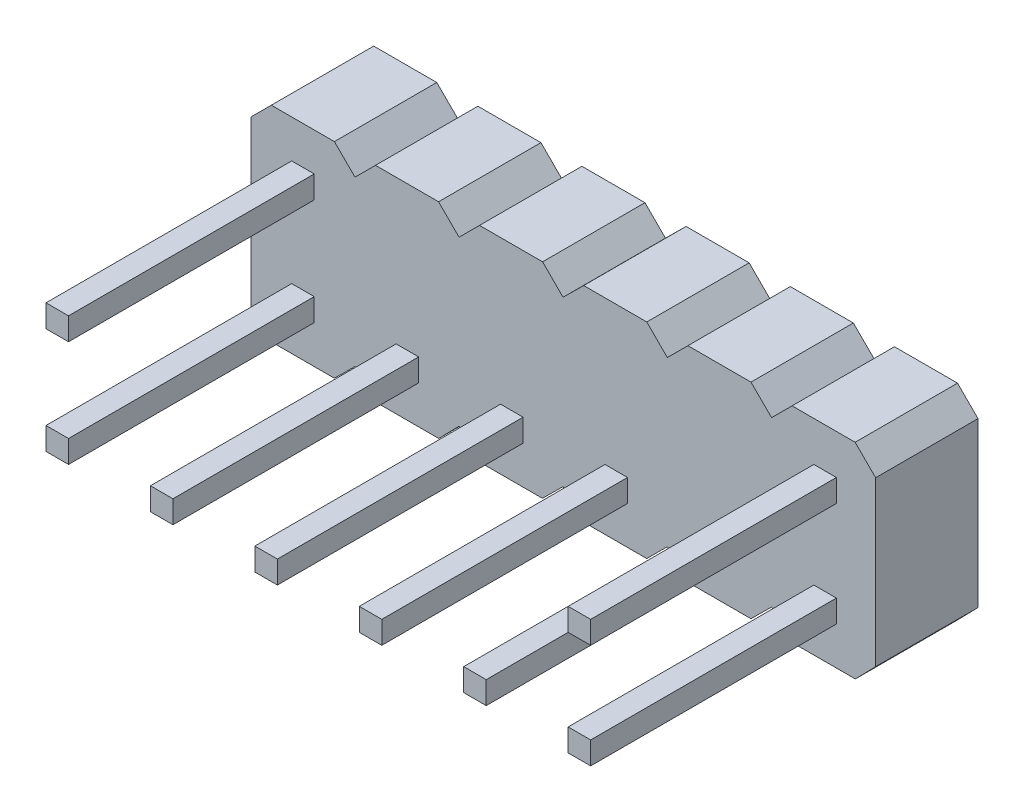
from build123d import *

# Parameters (mm, degrees)
BOSS_EXTRUDE1_DEPTH = 2.5
SKETCH2_W           = 0.55
SKETCH2_H           = 0.55
BOSS_EXTRUDE2_DEPTH = 6


with BuildPart() as part:
    # Sketch1 → Boss-Extrude1 (new body)
    with BuildSketch(Plane.XY):
        Polygon((0, 0), (0, 4), (0.502045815, 4.502045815), (2.042045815, 4.502045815), (2.546129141, 4.002045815), (3.046129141, 4.502045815), (4.586129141, 4.502045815), (5.086129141, 4.002045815), (5.586129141, 4.502045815), (7.126129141, 4.502045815), (7.626129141, 4.002045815), (8.130212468, 4.502045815), (9.670212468, 4.502045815), (10.172258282, 4), (10.674304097, 4.502045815), (12.214304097, 4.502045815), (12.718387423, 4.002045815), (13.218387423, 4.502045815), (14.758387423, 4.502045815), (15.258387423, 4.002045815), (15.258387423, 0.006055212), (14.76247075, -0.502045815), (13.22247075, -0.502045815), (12.718387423, -0.002045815), (12.214304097, -0.502045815), (10.674304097, -0.502045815), (10.172258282, 0), (9.670212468, -0.502045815), (8.130212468, -0.502045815), (7.626129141, -0.002045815), (7.122045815, -0.502045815), (5.582045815, -0.502045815), (5.086129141, 0.006055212), (4.590212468, -0.502045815), (3.050212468, -0.502045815), (2.546129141, -0.002045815), (2.042045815, -0.502045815), (0.502045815, -0.502045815), align=None)
    extrude(amount=BOSS_EXTRUDE1_DEPTH)

    # Sketch2 → Boss-Extrude2 (add)
    with BuildSketch(Plane.XY.offset(2.5)):
        with Locations((1.275, 0.702954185)):
            Rectangle(SKETCH2_W, SKETCH2_H)
        with Locations((1.275, 3.297045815)):
            Rectangle(SKETCH2_W, SKETCH2_H)
        with Locations((3.825, 0.702954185)):
            Rectangle(SKETCH2_W, SKETCH2_H)
        with Locations((6.375, 0.702954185)):
            Rectangle(SKETCH2_W, SKETCH2_H)
        with Locations((8.925, 0.702954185)):
            Rectangle(SKETCH2_W, SKETCH2_H)
        with Locations((11.475, 0.702954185)):
            Rectangle(SKETCH2_W, SKETCH2_H)
        with Locations((14.025, 0.702954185)):
            Rectangle(SKETCH2_W, SKETCH2_H)
        with Locations((14.025, 3.252954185)):
            Rectangle(SKETCH2_W, SKETCH2_H)
    extrude(amount=BOSS_EXTRUDE2_DEPTH)


solid = part.part
